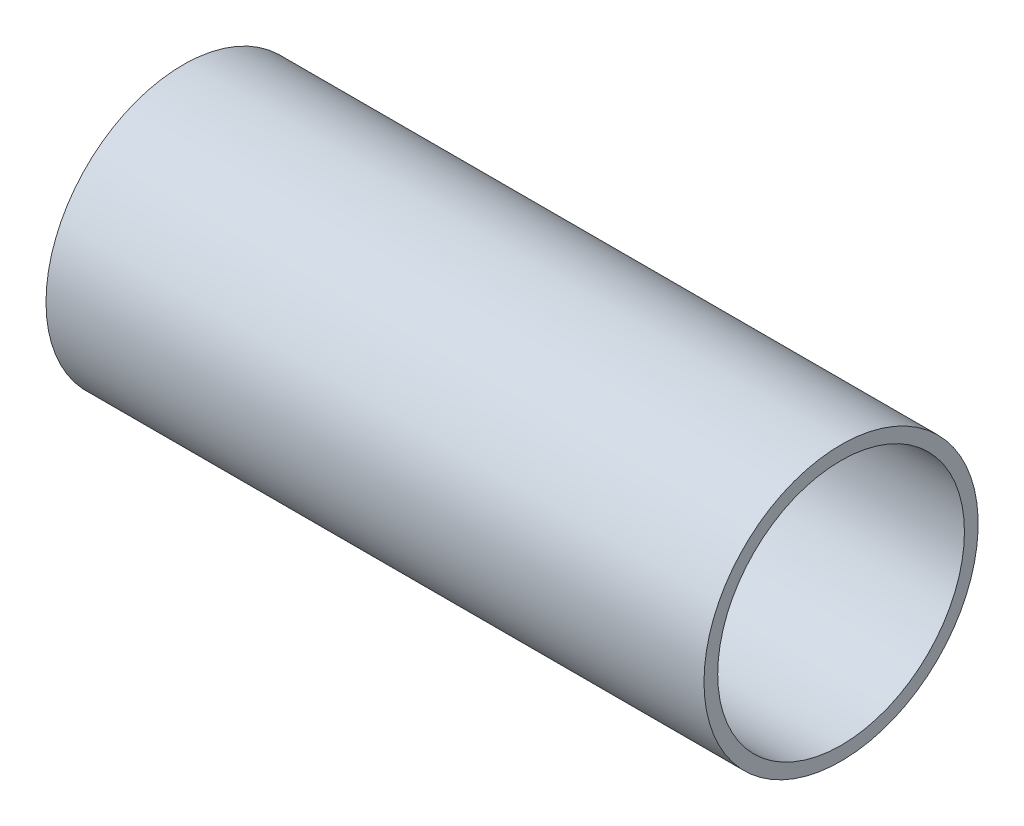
from build123d import *

# Parameters (mm, degrees)
SKETCH1_R          = 15.875
SKETCH1_R_2        = 14.2875
BASE_EXTRUDE_DEPTH = 76.2


with BuildPart() as part:
    # Sketch1 → Base-Extrude (new body)
    with BuildSketch(Plane(origin=(0, 0, 0), x_dir=(0, 0, -1), z_dir=(1, 0, 0))):
        with Locations(Location((0, 0, 0), (0, 0, 180))):
            Circle(SKETCH1_R)
        with Locations(Location((0, 0, 0), (0, 0, 180))):
            Circle(SKETCH1_R_2, mode=Mode.SUBTRACT)
    extrude(amount=BASE_EXTRUDE_DEPTH)


solid = part.part
